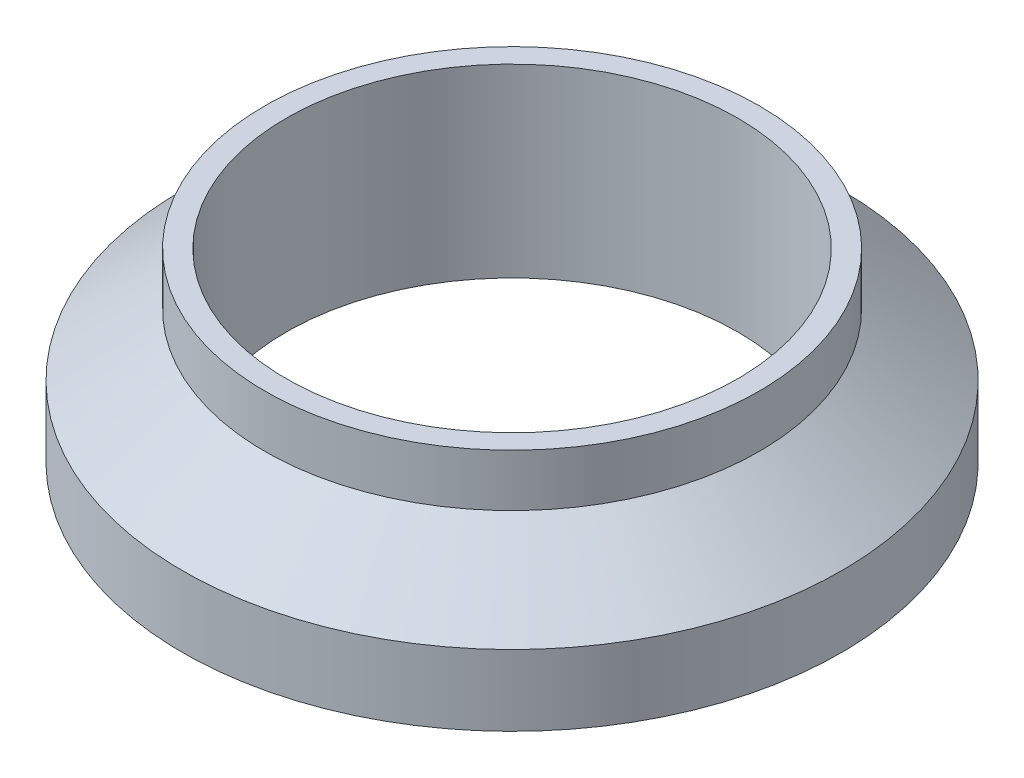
ISO-10303-21;
HEADER;
FILE_DESCRIPTION(('STEP AP214'),'2;1');
FILE_NAME('part.step','',(''),(''),'','','');
FILE_SCHEMA(('AUTOMOTIVE_DESIGN { 1 0 10303 214 1 1 1 1 }'));
ENDSEC;
DATA;
#1=APPLICATION_CONTEXT('core data for automotive mechanical design processes');
#2=APPLICATION_PROTOCOL_DEFINITION('international standard','automotive_design',2000,#1);
#3=PRODUCT_CONTEXT('',#1,'mechanical');
#4=PRODUCT('Part','Part','',(#3));
#5=PRODUCT_RELATED_PRODUCT_CATEGORY('part','',(#4));
#6=PRODUCT_DEFINITION_FORMATION('','',#4);
#7=PRODUCT_DEFINITION_CONTEXT('part definition',#1,'design');
#8=PRODUCT_DEFINITION('design','',#6,#7);
#9=PRODUCT_DEFINITION_SHAPE('','',#8);
#10=(LENGTH_UNIT() NAMED_UNIT(*) SI_UNIT(.MILLI.,.METRE.));
#11=(NAMED_UNIT(*) PLANE_ANGLE_UNIT() SI_UNIT($,.RADIAN.));
#12=(NAMED_UNIT(*) SI_UNIT($,.STERADIAN.) SOLID_ANGLE_UNIT());
#13=UNCERTAINTY_MEASURE_WITH_UNIT(LENGTH_MEASURE(1.E-05),#10,'distance_accuracy_value','');
#14=(GEOMETRIC_REPRESENTATION_CONTEXT(3) GLOBAL_UNCERTAINTY_ASSIGNED_CONTEXT((#13)) GLOBAL_UNIT_ASSIGNED_CONTEXT((#10,
#11,#12)) REPRESENTATION_CONTEXT('',''));
#15=CARTESIAN_POINT('',(0.,0.,0.));
#16=DIRECTION('',(0.,0.,1.));
#17=DIRECTION('',(1.,0.,0.));
#18=AXIS2_PLACEMENT_3D('',#15,#16,#17);
#19=CARTESIAN_POINT('',(-17.399,0.,0.));
#20=DIRECTION('',(0.,1.,0.));
#21=DIRECTION('',(0.,0.,1.));
#22=AXIS2_PLACEMENT_3D('',#19,#20,#21);
#23=PLANE('',#22);
#24=CARTESIAN_POINT('',(0.,0.,0.));
#25=DIRECTION('',(0.,-1.,0.));
#26=DIRECTION('',(0.,0.,-1.));
#27=AXIS2_PLACEMENT_3D('',#24,#25,#26);
#28=CIRCLE('',#27,17.399);
#29=CARTESIAN_POINT('',(0.,0.,-17.399));
#30=VERTEX_POINT('',#29);
#31=EDGE_CURVE('E10',#30,#30,#28,.T.);
#32=ORIENTED_EDGE('',*,*,#31,.F.);
#33=EDGE_LOOP('',(#32));
#34=FACE_BOUND('',#33,.T.);
#35=CARTESIAN_POINT('',(0.,0.,0.));
#36=DIRECTION('',(0.,-1.,0.));
#37=DIRECTION('',(0.,0.,-1.));
#38=AXIS2_PLACEMENT_3D('',#35,#36,#37);
#39=CIRCLE('',#38,20.2905836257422);
#40=CARTESIAN_POINT('',(0.,0.,-20.2905836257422));
#41=VERTEX_POINT('',#40);
#42=EDGE_CURVE('E59',#41,#41,#39,.T.);
#43=ORIENTED_EDGE('',*,*,#42,.T.);
#44=EDGE_LOOP('',(#43));
#45=FACE_BOUND('',#44,.T.);
#46=ADVANCED_FACE('F31',(#34,#45),#23,.F.);
#47=CARTESIAN_POINT('',(0.,0.,0.));
#48=DIRECTION('',(0.,-1.,0.));
#49=DIRECTION('',(0.,0.,-1.));
#50=AXIS2_PLACEMENT_3D('',#47,#48,#49);
#51=CYLINDRICAL_SURFACE('',#50,17.399);
#52=CARTESIAN_POINT('',(0.,14.2748,0.));
#53=DIRECTION('',(0.,-1.,0.));
#54=DIRECTION('',(0.,0.,-1.));
#55=AXIS2_PLACEMENT_3D('',#52,#53,#54);
#56=CIRCLE('',#55,17.399);
#57=CARTESIAN_POINT('',(0.,14.2748,-17.399));
#58=VERTEX_POINT('',#57);
#59=EDGE_CURVE('E37',#58,#58,#56,.T.);
#60=ORIENTED_EDGE('',*,*,#59,.F.);
#61=EDGE_LOOP('',(#60));
#62=FACE_BOUND('',#61,.T.);
#63=ORIENTED_EDGE('',*,*,#31,.T.);
#64=EDGE_LOOP('',(#63));
#65=FACE_BOUND('',#64,.T.);
#66=ADVANCED_FACE('F96',(#62,#65),#51,.F.);
#67=CARTESIAN_POINT('',(-17.399,14.2748,0.));
#68=DIRECTION('',(0.,-1.,0.));
#69=DIRECTION('',(0.,0.,-1.));
#70=AXIS2_PLACEMENT_3D('',#67,#68,#69);
#71=PLANE('',#70);
#72=CARTESIAN_POINT('',(0.,14.2748,0.));
#73=DIRECTION('',(0.,-1.,0.));
#74=DIRECTION('',(0.,0.,-1.));
#75=AXIS2_PLACEMENT_3D('',#72,#73,#74);
#76=CIRCLE('',#75,19.05);
#77=CARTESIAN_POINT('',(0.,14.2748,-19.05));
#78=VERTEX_POINT('',#77);
#79=EDGE_CURVE('E41',#78,#78,#76,.T.);
#80=ORIENTED_EDGE('',*,*,#79,.F.);
#81=EDGE_LOOP('',(#80));
#82=FACE_BOUND('',#81,.T.);
#83=ORIENTED_EDGE('',*,*,#59,.T.);
#84=EDGE_LOOP('',(#83));
#85=FACE_BOUND('',#84,.T.);
#86=ADVANCED_FACE('F91',(#82,#85),#71,.F.);
#87=CARTESIAN_POINT('',(0.,0.,0.));
#88=DIRECTION('',(0.,-1.,0.));
#89=DIRECTION('',(0.,0.,-1.));
#90=AXIS2_PLACEMENT_3D('',#87,#88,#89);
#91=CYLINDRICAL_SURFACE('',#90,19.05);
#92=CARTESIAN_POINT('',(0.,10.2460682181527,0.));
#93=DIRECTION('',(0.,-1.,0.));
#94=DIRECTION('',(0.,0.,-1.));
#95=AXIS2_PLACEMENT_3D('',#92,#93,#94);
#96=CIRCLE('',#95,19.05);
#97=CARTESIAN_POINT('',(0.,10.2460682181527,-19.05));
#98=VERTEX_POINT('',#97);
#99=EDGE_CURVE('E45',#98,#98,#96,.T.);
#100=ORIENTED_EDGE('',*,*,#99,.F.);
#101=EDGE_LOOP('',(#100));
#102=FACE_BOUND('',#101,.T.);
#103=ORIENTED_EDGE('',*,*,#79,.T.);
#104=EDGE_LOOP('',(#103));
#105=FACE_BOUND('',#104,.T.);
#106=ADVANCED_FACE('F85',(#102,#105),#91,.T.);
#107=CARTESIAN_POINT('',(0.,10.2460682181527,0.));
#108=DIRECTION('',(0.,-1.,0.));
#109=DIRECTION('',(0.,0.,-1.));
#110=AXIS2_PLACEMENT_3D('',#107,#108,#109);
#111=CONICAL_SURFACE('',#110,19.05,0.925024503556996);
#112=CARTESIAN_POINT('',(0.,5.461,0.));
#113=DIRECTION('',(0.,-1.,0.));
#114=DIRECTION('',(0.,0.,-1.));
#115=AXIS2_PLACEMENT_3D('',#112,#113,#114);
#116=CIRCLE('',#115,25.4);
#117=CARTESIAN_POINT('',(0.,5.461,-25.4));
#118=VERTEX_POINT('',#117);
#119=EDGE_CURVE('E50',#118,#118,#116,.T.);
#120=ORIENTED_EDGE('',*,*,#119,.F.);
#121=EDGE_LOOP('',(#120));
#122=FACE_BOUND('',#121,.T.);
#123=ORIENTED_EDGE('',*,*,#99,.T.);
#124=EDGE_LOOP('',(#123));
#125=FACE_BOUND('',#124,.T.);
#126=ADVANCED_FACE('F79',(#122,#125),#111,.T.);
#127=CARTESIAN_POINT('',(0.,0.,0.));
#128=DIRECTION('',(0.,-1.,0.));
#129=DIRECTION('',(0.,0.,-1.));
#130=AXIS2_PLACEMENT_3D('',#127,#128,#129);
#131=CYLINDRICAL_SURFACE('',#130,25.4);
#132=CARTESIAN_POINT('',(0.,0.,0.));
#133=DIRECTION('',(0.,-1.,0.));
#134=DIRECTION('',(0.,0.,-1.));
#135=AXIS2_PLACEMENT_3D('',#132,#133,#134);
#136=CIRCLE('',#135,25.4);
#137=CARTESIAN_POINT('',(0.,0.,-25.4));
#138=VERTEX_POINT('',#137);
#139=EDGE_CURVE('E53',#138,#138,#136,.T.);
#140=ORIENTED_EDGE('',*,*,#139,.F.);
#141=EDGE_LOOP('',(#140));
#142=FACE_BOUND('',#141,.T.);
#143=ORIENTED_EDGE('',*,*,#119,.T.);
#144=EDGE_LOOP('',(#143));
#145=FACE_BOUND('',#144,.T.);
#146=ADVANCED_FACE('F73',(#142,#145),#131,.T.);
#147=CARTESIAN_POINT('',(-25.4,0.,0.));
#148=DIRECTION('',(0.,1.,0.));
#149=DIRECTION('',(0.,0.,1.));
#150=AXIS2_PLACEMENT_3D('',#147,#148,#149);
#151=PLANE('',#150);
#152=CARTESIAN_POINT('',(0.,0.,0.));
#153=DIRECTION('',(0.,-1.,0.));
#154=DIRECTION('',(0.,0.,-1.));
#155=AXIS2_PLACEMENT_3D('',#152,#153,#154);
#156=CIRCLE('',#155,23.3466163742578);
#157=CARTESIAN_POINT('',(0.,0.,-23.3466163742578));
#158=VERTEX_POINT('',#157);
#159=EDGE_CURVE('E56',#158,#158,#156,.T.);
#160=ORIENTED_EDGE('',*,*,#159,.F.);
#161=EDGE_LOOP('',(#160));
#162=FACE_BOUND('',#161,.T.);
#163=ORIENTED_EDGE('',*,*,#139,.T.);
#164=EDGE_LOOP('',(#163));
#165=FACE_BOUND('',#164,.T.);
#166=ADVANCED_FACE('F67',(#162,#165),#151,.F.);
#167=CARTESIAN_POINT('',(0.,-0.381,0.));
#168=DIRECTION('',(0.,-1.,0.));
#169=DIRECTION('',(0.,0.,-1.));
#170=AXIS2_PLACEMENT_3D('',#167,#168,#169);
#171=TOROIDAL_SURFACE('',#170,21.8186,1.5748);
#172=ORIENTED_EDGE('',*,*,#42,.F.);
#173=EDGE_LOOP('',(#172));
#174=FACE_BOUND('',#173,.T.);
#175=ORIENTED_EDGE('',*,*,#159,.T.);
#176=EDGE_LOOP('',(#175));
#177=FACE_BOUND('',#176,.T.);
#178=ADVANCED_FACE('F64',(#174,#177),#171,.F.);
#179=CLOSED_SHELL('',(#46,#66,#86,#106,#126,#146,#166,#178));
#180=MANIFOLD_SOLID_BREP('B2',#179);
#181=ADVANCED_BREP_SHAPE_REPRESENTATION('',(#18,#180),#14);
#182=SHAPE_DEFINITION_REPRESENTATION(#9,#181);
ENDSEC;
END-ISO-10303-21;
